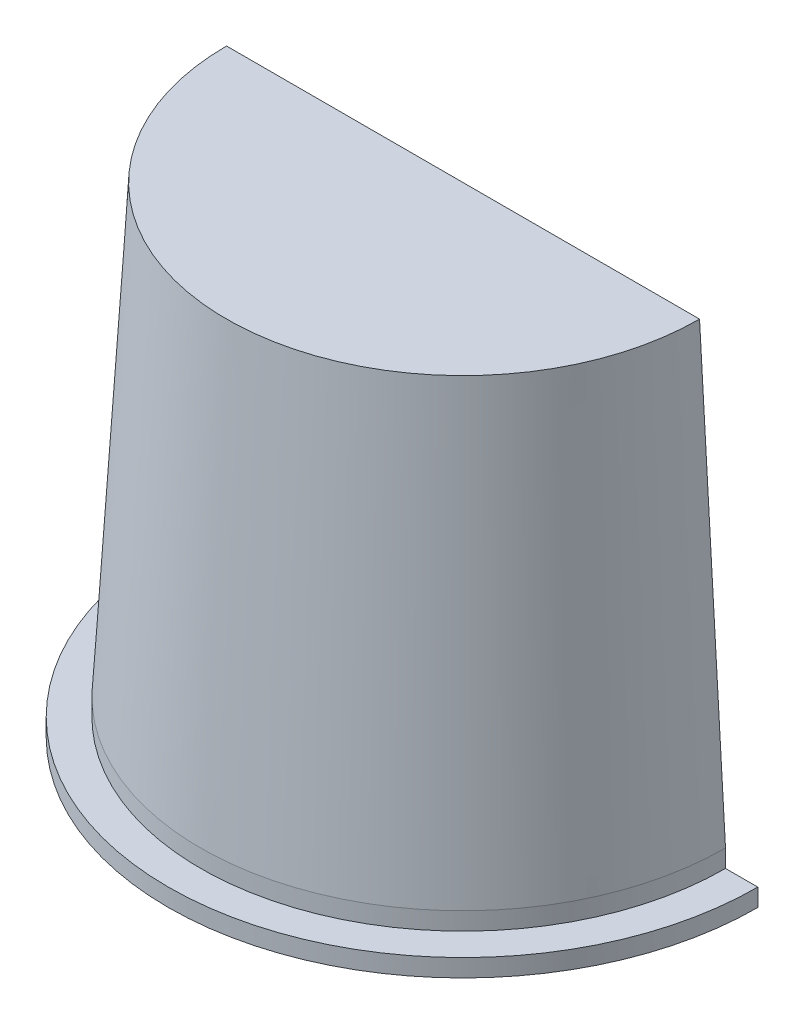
from build123d import *

# Parameters (mm, degrees)
SKETCH1_W           = 121.773097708
SKETCH1_H           = 96.065443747
CUT_EXTRUDE1_DEPTH  = 86.605043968
BOSS_EXTRUDE1_DEPTH = 3
BOSS_EXTRUDE2_DEPTH = 3


with BuildPart() as part:
    # Sketch 1 → Revolve 1 (revolve)
    with BuildSketch(Plane(origin=(0, 0, 0), x_dir=(0, 0, -1), z_dir=(1, 0, 0)), mode=Mode.PRIVATE) as revolve_1_sk:
        Polygon((-44.520913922, -17.501381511), (0, -17.501381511), (0, 58), (-40.116666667, 58), (-43.5, 0), align=None)
    revolve(revolve_1_sk.sketch.rotate(Axis((0, 0, 0), (0, 1, 0)), 180), axis=Axis((0, 0, 0), (0, 1, 0)))

    # Sketch1 → Cut-Extrude1 (cut, through all)
    with BuildSketch(Plane.XY):
        with Locations((4.234069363, 21.344343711)):
            Rectangle(SKETCH1_W, SKETCH1_H)
    extrude(amount=-CUT_EXTRUDE1_DEPTH, mode=Mode.SUBTRACT)

    # Sketch2 → Boss-Extrude1 (add)
    with BuildSketch(Plane.XZ.offset(17.501381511)):
        with BuildLine():
            Line((-44.520913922, 0), (44.520913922, 0))
            ThreePointArc((44.520913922, 0), (0, 44.520913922), (-44.520913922, 0))
        make_face()
    extrude(amount=BOSS_EXTRUDE1_DEPTH)

    # Sketch3 → Boss-Extrude2 (add)
    with BuildSketch(Plane.XZ.offset(20.501381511)):
        with BuildLine():
            Line((-50, 0), (50, 0))
            ThreePointArc((50, 0), (0, 50), (-50, 0))
        make_face()
    extrude(amount=BOSS_EXTRUDE2_DEPTH)


solid = part.part
